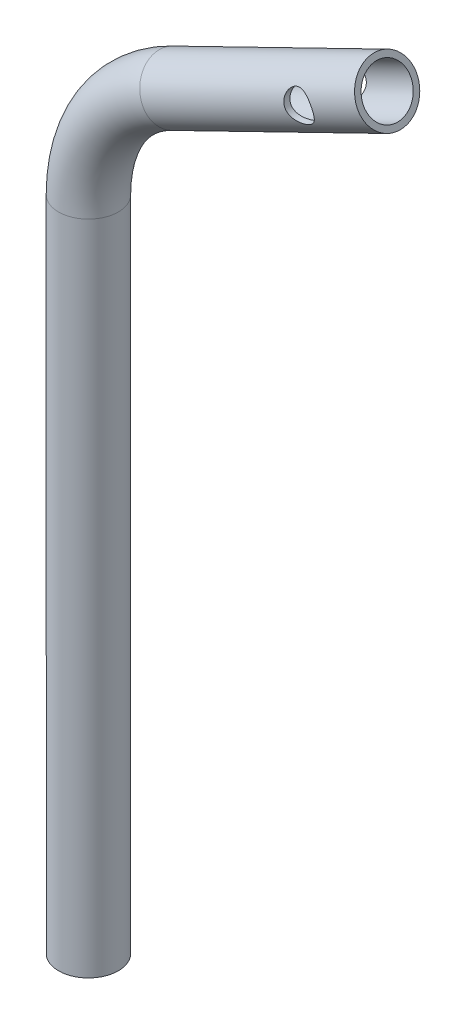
from build123d import *

# Parameters (mm, degrees)
ESQUISSE2_R             = 10
ESQUISSE2_R_2           = 8
ESQUISSE3_R             = 5
ENL_V_MAT_EXTRU_1_DEPTH = 10


with BuildPart() as part:
    # Balayage1: sweep along a path in Esquisse1
    with BuildLine(Plane.XY) as balayage1_path:
        Line((0, 0), (0, 220))
        ThreePointArc((0, 220), (7.6000848, 246.499947), (28.08988764, 264.943820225))
        Line((28.08988764, 264.943820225), (100, 300))
    # Esquisse2 → Balayage1 (sweep)
    with BuildSketch(Plane(origin=(0, 0, 0), x_dir=(1, 0, 0), z_dir=(0, 1, 0))):
        Circle(ESQUISSE2_R)
        Circle(ESQUISSE2_R_2, mode=Mode.SUBTRACT)
    sweep(path=balayage1_path.line)

    # Esquisse3 → Enl_v. mat.-Extru.1 (cut, symmetric)
    with BuildSketch(Plane.XY):
        with Locations((80.224719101, 290.359550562)):
            Circle(ESQUISSE3_R)
    extrude(amount=ENL_V_MAT_EXTRU_1_DEPTH, both=True, mode=Mode.SUBTRACT)


solid = part.part
